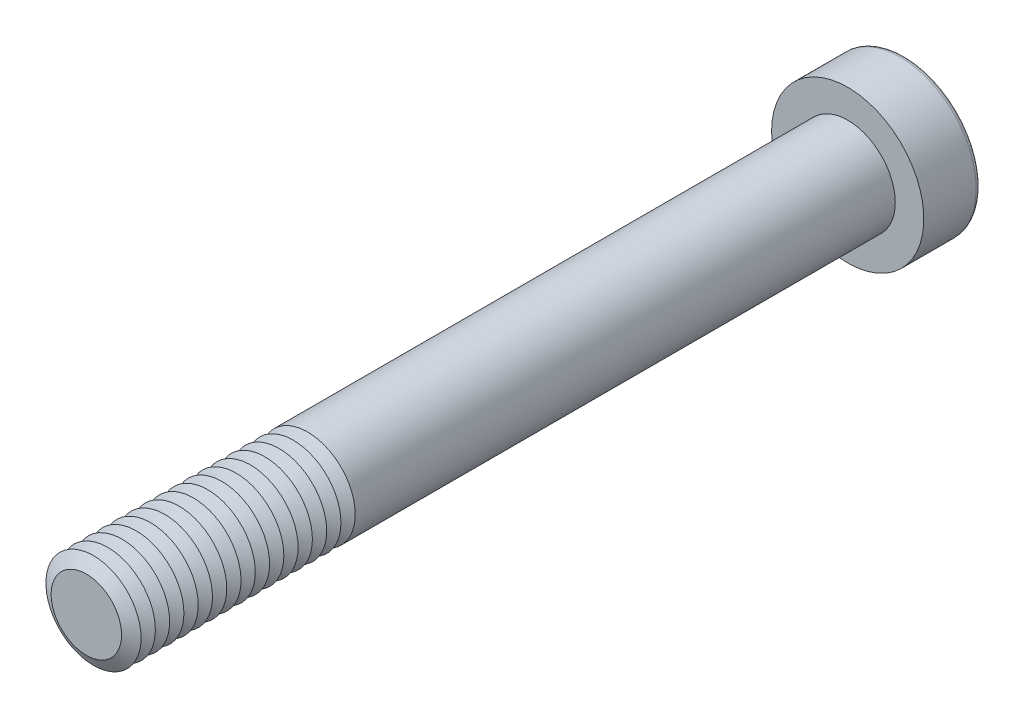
from build123d import *

# Parameters (mm, degrees)
SKETCH1_R           = 5
BOSS_EXTRUDE1_DEPTH = 80
SKETCH2_R           = 8
BOSS_EXTRUDE2_DEPTH = 6
CUT_EXTRUDE1_DEPTH  = 5.25
FILLET1_R           = 0.5
LPATTERN1_COUNT     = 16
LPATTERN1_PITCH     = 1.5


with BuildPart() as part:
    # Sketch1 → Boss-Extrude1 (new body)
    with BuildSketch(Plane.XY):
        Circle(SKETCH1_R)
    extrude(amount=BOSS_EXTRUDE1_DEPTH)

    # Sketch2 → Boss-Extrude2 (add)
    with BuildSketch(Plane(origin=(0, 0, 0), x_dir=(-1, 0, 0), z_dir=(0, 0, -1))):
        Circle(SKETCH2_R)
    extrude(amount=BOSS_EXTRUDE2_DEPTH)

    # Sketch3 → Cut-Extrude1 (cut)
    with BuildSketch(Plane(origin=(0, 0, -6), x_dir=(-1, 0, 0), z_dir=(0, 0, -1))):
        Polygon((-2.020725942, 3.5), (-4.041451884, 0), (-2.020725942, -3.5), (2.020725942, -3.5), (4.041451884, 0), (2.020725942, 3.5), align=None)
    extrude(amount=-CUT_EXTRUDE1_DEPTH, mode=Mode.SUBTRACT)

    # Fillet1
    fillet1_edges = [part.edges().sort_by_distance(p)[0] for p in [
        (8, 0, -6),
    ]]
    fillet(fillet1_edges, radius=FILLET1_R)

    # Cut-Extrude2 cone 1 section (on through the dimple's axis) → Cut-Extrude2 (revolve, cut)
    with BuildSketch(Plane(origin=(0, 0, -0.75), x_dir=(0, 1, 0), z_dir=(1, 0, 0))):
        Polygon((0, 0), (3.5, 0), (0, 2.020725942), align=None)
    revolve(axis=Axis((0, 0, -0.75), (0, 0, 1)), mode=Mode.SUBTRACT)

    # Cut-Extrude3 cone 1 section (on through the dimple's axis) → Cut-Extrude3 (revolve, cut)
    with BuildSketch(Plane(origin=(0, 0, -6), x_dir=(0, 1, 0), z_dir=(1, 0, 0))):
        Polygon((0, 0), (4.041451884, 0), (0, 1.082903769), align=None)
    revolve(axis=Axis((0, 0, -6), (0, 0, 1)), mode=Mode.SUBTRACT)

    # Sketch7 → Cut-Revolve1 (revolve, cut)
    with BuildSketch(Plane(origin=(0, 0, 0), x_dir=(0, 0, -1), z_dir=(1, 0, 0)), mode=Mode.PRIVATE) as cut_revolve1_sk:
        Polygon((-80, 3.700961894), (-79.25, 5), (-80.75, 5), align=None)
    cut_revolve1 = revolve(cut_revolve1_sk.sketch.rotate(Axis((0, 0, 80), (0, 0, -1)), 90), axis=Axis((0, 0, 80), (0, 0, -1)), mode=Mode.SUBTRACT)

    # LPattern1: Cut-Revolve1 ×16
    with Locations(*[(0, 0, -i * LPATTERN1_PITCH) for i in range(1, LPATTERN1_COUNT)]):
        add(cut_revolve1, mode=Mode.SUBTRACT)


solid = part.part
